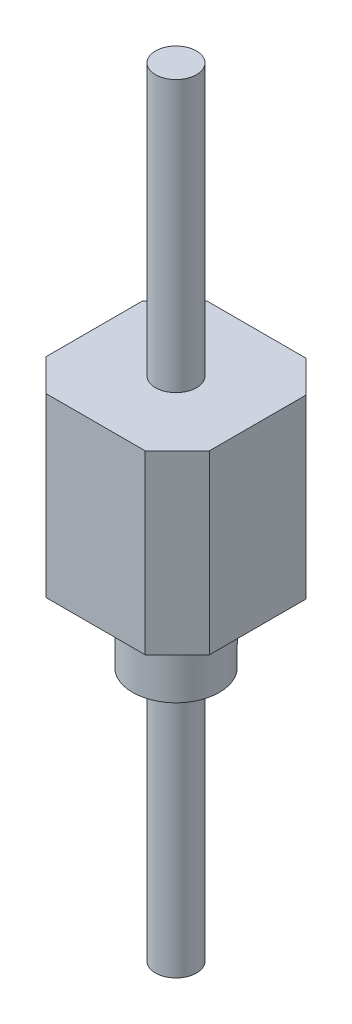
from build123d import *

# Parameters (mm, degrees)
BOSS_EXTRU_1_DEPTH = 2.75
ESQUISSE2_R        = 0.32
BOSS_EXTRU_2_DEPTH = 4.22
ESQUISSE3_R        = 0.675
BOSS_EXTRU_3_DEPTH = 1.18
BOSS_EXTRU_4_START = 3.96
ESQUISSE4_R        = 0.32
BOSS_EXTRU_4_DEPTH = 3.96


with BuildPart() as part:
    # Esquisse1 → Boss.-Extru.1 (new body)
    with BuildSketch(Plane(origin=(0, 0, 0), x_dir=(1, 0, 0), z_dir=(0, 1, 0))):
        Polygon((-1.27, 0.75), (-0.77, 1.25), (0.77, 1.25), (1.27, 0.75), (1.27, -0.75), (0.77, -1.25), (-0.77, -1.25), (-1.27, -0.75), align=None)
    extrude(amount=BOSS_EXTRU_1_DEPTH)

    # Esquisse2 → Boss.-Extru.2 (add)
    with BuildSketch(Plane(origin=(0, 2.75, 0), x_dir=(1, 0, 0), z_dir=(0, 1, 0))):
        with Locations(Location((0, 0, 0), (0, 0, 270))):
            Circle(ESQUISSE2_R)
    extrude(amount=BOSS_EXTRU_2_DEPTH)

    # Esquisse3 → Boss.-Extru.3 (add)
    with BuildSketch(Plane.XZ):
        with Locations(Location((0, 0, 0), (0, 0, 90))):
            Circle(ESQUISSE3_R)
    extrude(amount=BOSS_EXTRU_3_DEPTH)

    # Esquisse4 → Boss.-Extru.4 (add)
    with BuildSketch(Plane.XZ.offset(1.18).offset(BOSS_EXTRU_4_START)):
        with Locations(Location((0, 0, 0), (0, 0, 90))):
            Circle(ESQUISSE4_R)
    extrude(amount=-BOSS_EXTRU_4_DEPTH)


solid = part.part
